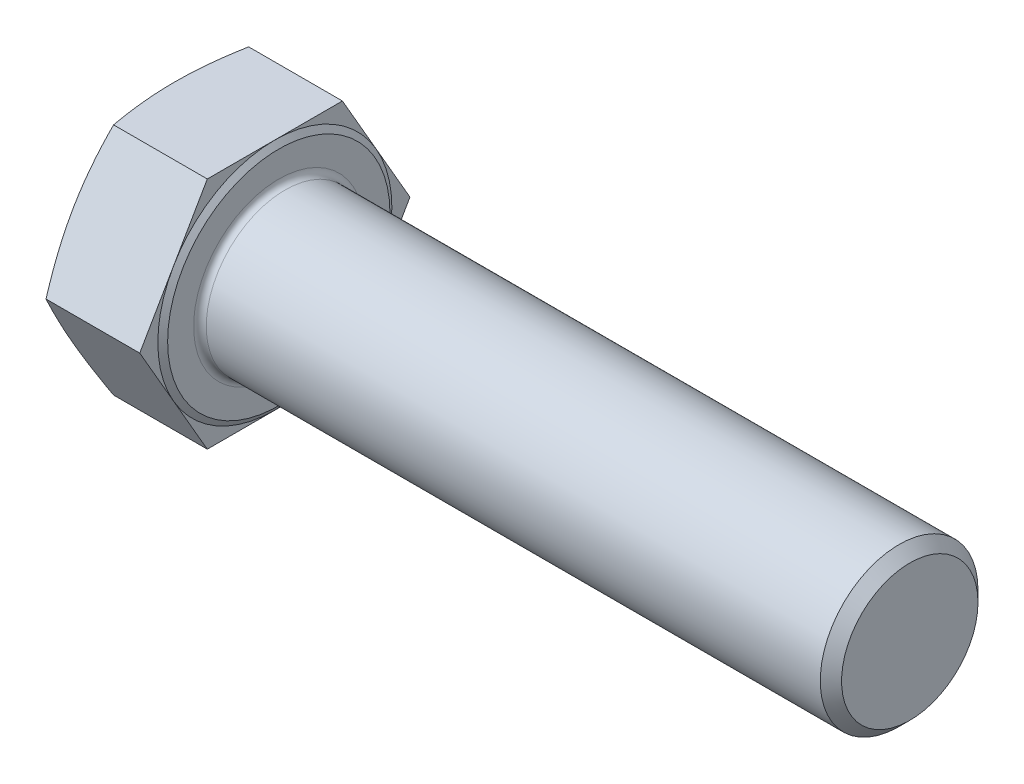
from build123d import *

# Parameters (mm, degrees)
BASEHEAD_DEPTH = 12.72
SKETCH3_R      = 10
BASEBODY_DEPTH = 80
HEADFILLET_R   = 0.8
CHAMFER1_SIZE  = 1.353


with BuildPart() as part:
    # Sketch-BaseHead → BaseHead (new body)
    with BuildSketch(Plane(origin=(0, 0, 0), x_dir=(0, 0, -1), z_dir=(1, 0, 0))):
        Polygon((17.129982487, 0), (8.564991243, 14.835), (-8.564991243, 14.835), (-17.129982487, 0), (-8.564991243, -14.835), (8.564991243, -14.835), align=None)
    extrude(amount=BASEHEAD_DEPTH)

    # Sketch4 → HeadChamfer (revolve, cut)
    with BuildSketch(Plane(origin=(-0.264637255, 0, 5.916896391), x_dir=(0, 0, -1), z_dir=(0, 1, 0))):
        Polygon((23.046878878, -0.264637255), (20.751896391, -0.264637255), (23.046878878, -1.099942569), align=None)
    revolve(axis=Axis((-4.001564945, 0, 0), (1, 0, 0)), mode=Mode.SUBTRACT)

    # Sketch1 → Revolve1 (revolve)
    with BuildSketch(Plane.XY, mode=Mode.PRIVATE) as revolve1_sk:
        Polygon((12.72, 0), (13.22, 0), (13.22, -14.095), (12.72, -14.835), align=None)
    revolve(revolve1_sk.sketch.rotate(Axis((-4.001564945, 0, 0), (1, 0, 0)), 270), axis=Axis((-4.001564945, 0, 0), (1, 0, 0)))

    # Sketch3 → BaseBody (add)
    with BuildSketch(Plane(origin=(13.22, 0, 0), x_dir=(0, 0, -1), z_dir=(1, 0, 0))):
        Circle(SKETCH3_R)
    extrude(amount=BASEBODY_DEPTH)

    # HeadFillet
    headfillet_edges = [part.edges().sort_by_distance(p)[0] for p in [
        (13.22, 0, 10),
    ]]
    fillet(headfillet_edges, radius=HEADFILLET_R)

    # Chamfer1
    chamfer1_edges = [part.edges().sort_by_distance(p)[0] for p in [
        (93.22, 0, 10),
    ]]
    chamfer(chamfer1_edges, length=CHAMFER1_SIZE)


solid = part.part
